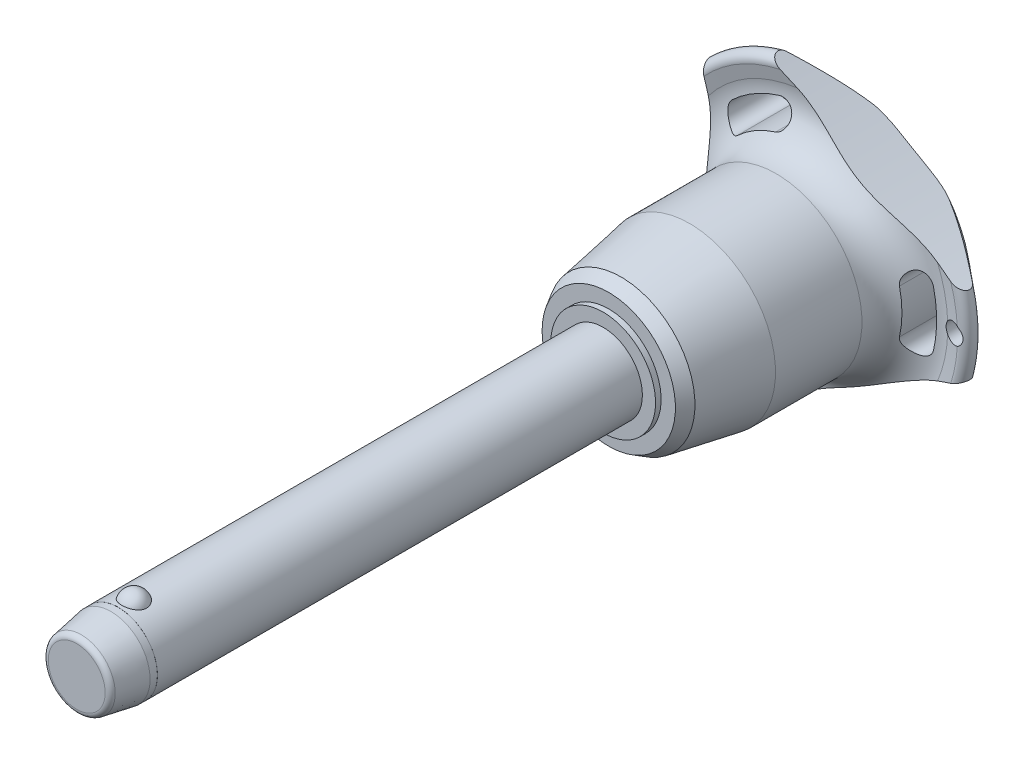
from build123d import *

# Parameters (mm, degrees)
SKETCH1_R           = 6
BOSS_EXTRUDE1_DEPTH = 70
SKETCH2_R           = 5.15
BOSS_EXTRUDE2_DEPTH = 39.7
BOSS_EXTRUDE3_START = 10.6
SKETCH1_2_R         = 6
BOSS_EXTRUDE3_DEPTH = 10.6
CHAMFER1_SIZE       = 5.3
CHAMFER1_SIZE2      = 0.934532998
FILLET1_R           = 0.85
SKETCH6_R           = 144.275
CUT_EXTRUDE1_DEPTH  = 115.750268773
CIRPATTERN1_COUNT   = 3
SKETCH7_R           = 1.5
CUT_EXTRUDE2_DEPTH  = 115.575242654
SKETCH8_R           = 6
SKETCH8_R_2         = 5.99
CUT_EXTRUDE3_DEPTH  = 6.36


with BuildPart() as part:
    # Sketch1 → Boss-Extrude1 (new body)
    with BuildSketch(Plane.XY):
        Circle(SKETCH1_R)
    extrude(amount=-BOSS_EXTRUDE1_DEPTH)

    # Sketch2 → Boss-Extrude2 (add)
    with BuildSketch(Plane(origin=(0, 0, -70), x_dir=(-1, 0, 0), z_dir=(0, 0, -1))):
        Circle(SKETCH2_R)
    extrude(amount=BOSS_EXTRUDE2_DEPTH)

    # Sketch3 → Revolve1 (revolve)
    with BuildSketch(Plane(origin=(0, 0, 0), x_dir=(0, 0, -1), z_dir=(1, 0, 0))):
        with BuildLine():
            Line((-1.854049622, 7.25), (-1.854049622, 3.25))
            ThreePointArc((-1.854049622, 3.25), (0.145950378, 5.25), (-1.854049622, 7.25))
        make_face()
        with BuildLine():
            Line((-1.854049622, -3.25), (-1.854049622, -7.25))
            ThreePointArc((-1.854049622, -7.25), (0.145950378, -5.25), (-1.854049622, -3.25))
        make_face()
    revolve(axis=Axis((0, -3.25, 1.854049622), (0, 1, 0)))

    # Sketch1_2 → Boss-Extrude3 (add)
    with BuildSketch(Plane.XY.offset(BOSS_EXTRUDE3_START)):
        Circle(SKETCH1_2_R)
    extrude(amount=-BOSS_EXTRUDE3_DEPTH)

    # Chamfer1
    chamfer1_edges = [part.edges().sort_by_distance(p)[0] for p in [
        (-6, 0, 10.6),
    ]]
    chamfer1_side = [part.faces().sort_by_distance(p)[0] for p in [
        (-6, 0, -29.7),
    ]]
    chamfer(chamfer1_edges, length=CHAMFER1_SIZE, length2=CHAMFER1_SIZE2, reference=chamfer1_side[0])

    # Fillet1
    fillet1_edges = [part.edges().sort_by_distance(p)[0] for p in [
        (-5.065467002, 0, 10.6),
        (5.15, 0, -109.7),
    ]]
    fillet(fillet1_edges, radius=FILLET1_R)

    # Sketch4 → Revolve2 (revolve)
    with BuildSketch(Plane(origin=(0, 0, 0), x_dir=(0, 0, -1), z_dir=(1, 0, 0)), mode=Mode.PRIVATE) as revolve2_sk:
        Polygon((70, 0), (70, 8.017240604), (70.85, 8.017240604), (70.85, 10.206249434), (72.745737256, 11.300753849), (83.233333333, 13.15), (96.466666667, 13.15), (96.466666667, 0), align=None)
    revolve(revolve2_sk.sketch.rotate(Axis((0, 0, -96.466666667), (0, 0, 1)), 90), axis=Axis((0, 0, -96.466666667), (0, 0, 1)))

    # Sketch5 → Revolve3 (revolve)
    with BuildSketch(Plane(origin=(0, 0, 0), x_dir=(0, 0, -1), z_dir=(1, 0, 0)), mode=Mode.PRIVATE) as revolve3_sk:
        with BuildLine():
            Line((102.32877039, 20.428960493), (101.910912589, 22.344207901))
            ThreePointArc((101.910912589, 22.344207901), (102.554394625, 23.677136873), (104.002586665, 23.371345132))
            Line((104.002586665, 23.371345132), (109.141488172, 17.247040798))
            ThreePointArc((109.141488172, 17.247040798), (109.7, 15.584758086), (108.978803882, 13.986322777))
            ThreePointArc((108.978803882, 13.986322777), (104.617427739, 7.589034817), (103.083333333, 0))
            Line((103.083333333, 0), (96.466666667, 0))
            Line((96.466666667, 0), (96.466666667, 13.15))
            ThreePointArc((96.466666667, 13.15), (101.139661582, 15.38660811), (102.32877039, 20.428960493))
        make_face()
    revolve(revolve3_sk.sketch.rotate(Axis((0, 0, -103.083333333), (0, 0, 1)), 90), axis=Axis((0, 0, -103.083333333), (0, 0, 1)))

    # Sketch6 → Cut-Extrude1 (cut, through all)
    with BuildSketch(Plane.XY):
        with Locations((-159.975, 0)):
            Circle(SKETCH6_R)
        with BuildLine():
            ThreePointArc((18.131206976, -4.190753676), (18.60922037, 0), (18.131206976, 4.190753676))
            ThreePointArc((18.131206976, 4.190753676), (15.94840906, 5.553949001), (14.585213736, 3.371151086))
            ThreePointArc((14.585213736, 3.371151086), (14.969740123, 0), (14.585213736, -3.371151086))
            ThreePointArc((14.585213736, -3.371151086), (15.94840906, -5.553949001), (18.131206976, -4.190753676))
        make_face()
    cut_extrude1 = extrude(amount=-CUT_EXTRUDE1_DEPTH, mode=Mode.SUBTRACT)

    # CirPattern1: Cut-Extrude1 ×3 about axis
    cirpattern1_axis = Axis((0, 0, 0), (0, 0, 1))
    for i in range(1, CIRPATTERN1_COUNT):
        add(cut_extrude1.rotate(cirpattern1_axis, i * 360 / CIRPATTERN1_COUNT), mode=Mode.SUBTRACT)

    # Sketch7 → Cut-Extrude2 (cut, through all)
    with BuildSketch(Plane.XY):
        with Locations(Location((21.60922037, 0, 0), (0, 0, 297.620773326))):
            Circle(SKETCH7_R)
    extrude(amount=-CUT_EXTRUDE2_DEPTH, mode=Mode.SUBTRACT)

    # Sketch8 → Cut-Extrude3 (cut)
    with BuildSketch(Plane.XY.offset(10.6)):
        Circle(SKETCH8_R)
        Circle(SKETCH8_R_2, mode=Mode.SUBTRACT)
    extrude(amount=-CUT_EXTRUDE3_DEPTH, mode=Mode.SUBTRACT)


solid = part.part
